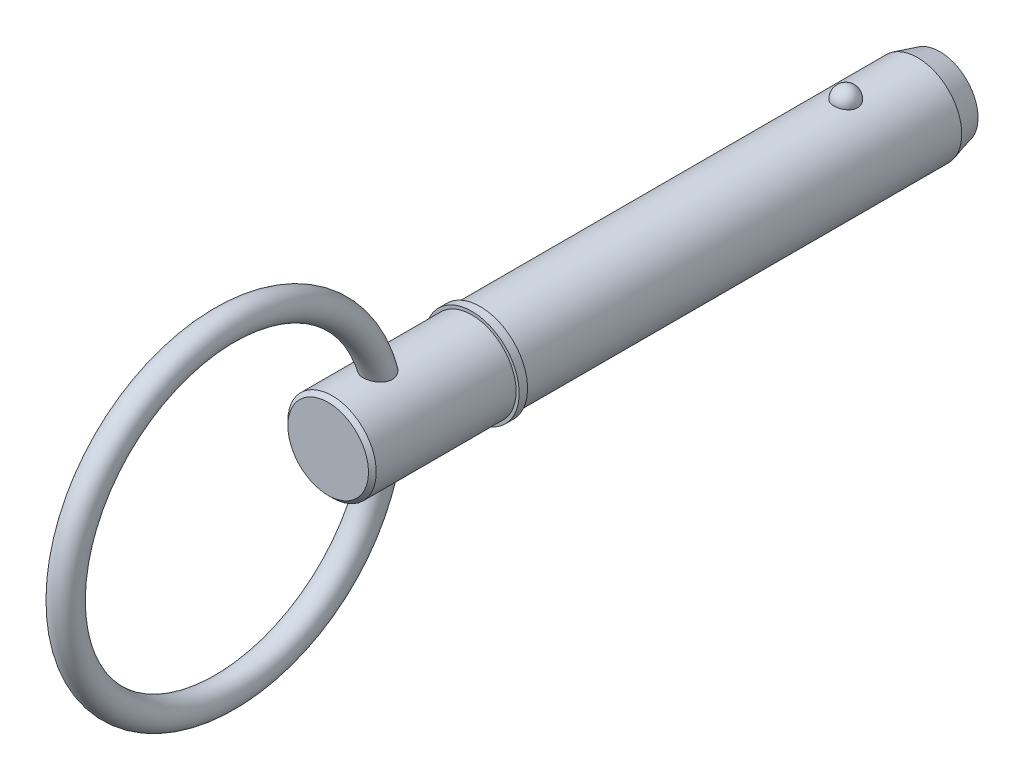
ISO-10303-21;
HEADER;
FILE_DESCRIPTION(('STEP AP214'),'2;1');
FILE_NAME('part.step','',(''),(''),'','','');
FILE_SCHEMA(('AUTOMOTIVE_DESIGN { 1 0 10303 214 1 1 1 1 }'));
ENDSEC;
DATA;
#1=APPLICATION_CONTEXT('core data for automotive mechanical design processes');
#2=APPLICATION_PROTOCOL_DEFINITION('international standard','automotive_design',2000,#1);
#3=PRODUCT_CONTEXT('',#1,'mechanical');
#4=PRODUCT('Part','Part','',(#3));
#5=PRODUCT_RELATED_PRODUCT_CATEGORY('part','',(#4));
#6=PRODUCT_DEFINITION_FORMATION('','',#4);
#7=PRODUCT_DEFINITION_CONTEXT('part definition',#1,'design');
#8=PRODUCT_DEFINITION('design','',#6,#7);
#9=PRODUCT_DEFINITION_SHAPE('','',#8);
#10=(LENGTH_UNIT() NAMED_UNIT(*) SI_UNIT(.MILLI.,.METRE.));
#11=(NAMED_UNIT(*) PLANE_ANGLE_UNIT() SI_UNIT($,.RADIAN.));
#12=(NAMED_UNIT(*) SI_UNIT($,.STERADIAN.) SOLID_ANGLE_UNIT());
#13=UNCERTAINTY_MEASURE_WITH_UNIT(LENGTH_MEASURE(1.E-05),#10,'distance_accuracy_value','');
#14=(GEOMETRIC_REPRESENTATION_CONTEXT(3) GLOBAL_UNCERTAINTY_ASSIGNED_CONTEXT((#13)) GLOBAL_UNIT_ASSIGNED_CONTEXT((#10,
#11,#12)) REPRESENTATION_CONTEXT('',''));
#15=CARTESIAN_POINT('',(0.,0.,0.));
#16=DIRECTION('',(0.,0.,1.));
#17=DIRECTION('',(1.,0.,0.));
#18=AXIS2_PLACEMENT_3D('',#15,#16,#17);
#19=CARTESIAN_POINT('',(0.,0.,63.5));
#20=DIRECTION('',(0.,0.,-1.));
#21=DIRECTION('',(-1.,0.,0.));
#22=AXIS2_PLACEMENT_3D('',#19,#20,#21);
#23=CYLINDRICAL_SURFACE('',#22,7.94);
#24=CARTESIAN_POINT('',(2.13020349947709,7.64891057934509,-2.15));
#25=CARTESIAN_POINT('',(2.1302012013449,7.64891247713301,-2.02978166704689));
#26=CARTESIAN_POINT('',(2.12037546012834,7.65166842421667,-1.90953383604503));
#27=CARTESIAN_POINT('',(2.08130792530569,7.66238579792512,-1.67243962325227));
#28=CARTESIAN_POINT('',(2.05205785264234,7.67034944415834,-1.55559471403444));
#29=CARTESIAN_POINT('',(1.97489181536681,7.69057749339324,-1.32869361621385));
#30=CARTESIAN_POINT('',(1.92698409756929,7.70283999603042,-1.21863445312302));
#31=CARTESIAN_POINT('',(1.81370645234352,7.73029430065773,-1.00831338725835));
#32=CARTESIAN_POINT('',(1.74833715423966,7.7454859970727,-0.908051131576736));
#33=CARTESIAN_POINT('',(1.60144242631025,7.77718699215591,-0.719628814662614));
#34=CARTESIAN_POINT('',(1.51984382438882,7.7937020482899,-0.631526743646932));
#35=CARTESIAN_POINT('',(1.34279837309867,7.82614685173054,-0.470411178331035));
#36=CARTESIAN_POINT('',(1.24735148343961,7.84207659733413,-0.397397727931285));
#37=CARTESIAN_POINT('',(1.04544839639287,7.87153116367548,-0.26868118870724));
#38=CARTESIAN_POINT('',(0.939022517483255,7.88506234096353,-0.212932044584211));
#39=CARTESIAN_POINT('',(0.717931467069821,7.90825597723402,-0.120080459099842));
#40=CARTESIAN_POINT('',(0.603267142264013,7.9179188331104,-0.0829761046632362));
#41=CARTESIAN_POINT('',(0.371015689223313,7.93216561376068,-0.0289596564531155));
#42=CARTESIAN_POINT('',(0.253510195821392,7.93683225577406,-0.0117183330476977));
#43=CARTESIAN_POINT('',(0.0171784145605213,7.94086051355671,0.0031892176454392));
#44=CARTESIAN_POINT('',(-0.101647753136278,7.94022260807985,0.00085721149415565));
#45=CARTESIAN_POINT('',(-0.335567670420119,7.93375751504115,-0.023146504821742));
#46=CARTESIAN_POINT('',(-0.450690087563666,7.92799987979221,-0.0445590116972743));
#47=CARTESIAN_POINT('',(-0.675610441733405,7.91200792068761,-0.105760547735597));
#48=CARTESIAN_POINT('',(-0.785408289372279,7.90177352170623,-0.145549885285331));
#49=CARTESIAN_POINT('',(-0.9972706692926,7.87784802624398,-0.242675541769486));
#50=CARTESIAN_POINT('',(-1.0992893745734,7.86413823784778,-0.300107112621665));
#51=CARTESIAN_POINT('',(-1.29223659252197,7.83474718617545,-0.430887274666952));
#52=CARTESIAN_POINT('',(-1.38316404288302,7.81906573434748,-0.504237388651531));
#53=CARTESIAN_POINT('',(-1.55313516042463,7.78710451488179,-0.666358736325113));
#54=CARTESIAN_POINT('',(-1.63193689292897,7.77081906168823,-0.75538257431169));
#55=CARTESIAN_POINT('',(-1.77366356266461,7.73970270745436,-0.945507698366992));
#56=CARTESIAN_POINT('',(-1.83658745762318,7.72487190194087,-1.04660977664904));
#57=CARTESIAN_POINT('',(-1.94556640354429,7.6981535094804,-1.25927689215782));
#58=CARTESIAN_POINT('',(-1.99143480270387,7.6862989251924,-1.3709418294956));
#59=CARTESIAN_POINT('',(-2.06418311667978,7.66708387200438,-1.60066153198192));
#60=CARTESIAN_POINT('',(-2.0910635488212,7.65972328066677,-1.71871612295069));
#61=CARTESIAN_POINT('',(-2.12508507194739,7.65035479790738,-1.9573607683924));
#62=CARTESIAN_POINT('',(-2.13230490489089,7.64832555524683,-2.0779387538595));
#63=CARTESIAN_POINT('',(-2.12704767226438,7.64978921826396,-2.31862835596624));
#64=CARTESIAN_POINT('',(-2.1145710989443,7.6532819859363,-2.43873998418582));
#65=CARTESIAN_POINT('',(-2.07034166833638,7.66536368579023,-2.67451689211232));
#66=CARTESIAN_POINT('',(-2.03867758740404,7.67392914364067,-2.79020005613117));
#67=CARTESIAN_POINT('',(-1.95694065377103,7.69517736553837,-3.01446692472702));
#68=CARTESIAN_POINT('',(-1.90686710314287,7.70786028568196,-3.12305035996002));
#69=CARTESIAN_POINT('',(-1.78925555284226,7.73600831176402,-3.3306597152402));
#70=CARTESIAN_POINT('',(-1.72162904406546,7.75148739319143,-3.4296336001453));
#71=CARTESIAN_POINT('',(-1.57074739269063,7.78346215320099,-3.61466914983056));
#72=CARTESIAN_POINT('',(-1.48749169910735,7.79995786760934,-3.70073035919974));
#73=CARTESIAN_POINT('',(-1.30720250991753,7.83219119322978,-3.85783594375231));
#74=CARTESIAN_POINT('',(-1.2101234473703,7.84792605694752,-3.92882863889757));
#75=CARTESIAN_POINT('',(-1.00503150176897,7.87681523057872,-4.05342383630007));
#76=CARTESIAN_POINT('',(-0.897019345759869,7.88996971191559,-4.10702749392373));
#77=CARTESIAN_POINT('',(-0.674439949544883,7.91208451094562,-4.19477736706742));
#78=CARTESIAN_POINT('',(-0.55996501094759,7.92109245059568,-4.22914554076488));
#79=CARTESIAN_POINT('',(-0.326625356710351,7.93413878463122,-4.27838865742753));
#80=CARTESIAN_POINT('',(-0.20776113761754,7.93817773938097,-4.29326579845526));
#81=CARTESIAN_POINT('',(0.0287357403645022,7.94081322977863,-4.3030062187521));
#82=CARTESIAN_POINT('',(0.14635312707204,7.93950453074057,-4.29821797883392));
#83=CARTESIAN_POINT('',(0.379062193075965,7.93180098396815,-4.26955229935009));
#84=CARTESIAN_POINT('',(0.494153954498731,7.92540630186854,-4.24567548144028));
#85=CARTESIAN_POINT('',(0.718185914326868,7.90824874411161,-4.17962260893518));
#86=CARTESIAN_POINT('',(0.827145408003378,7.89750055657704,-4.13750805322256));
#87=CARTESIAN_POINT('',(1.03638036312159,7.87277755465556,-4.03615078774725));
#88=CARTESIAN_POINT('',(1.13665531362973,7.85880255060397,-3.97690707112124));
#89=CARTESIAN_POINT('',(1.32729731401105,7.82887859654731,-3.84189297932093));
#90=CARTESIAN_POINT('',(1.41749828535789,7.81290379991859,-3.76589388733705));
#91=CARTESIAN_POINT('',(1.58397257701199,7.78086330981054,-3.59992466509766));
#92=CARTESIAN_POINT('',(1.66024342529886,7.76479760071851,-3.50995206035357));
#93=CARTESIAN_POINT('',(1.79805631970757,7.73405928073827,-3.31688321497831));
#94=CARTESIAN_POINT('',(1.85933944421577,7.719413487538,-3.213597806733));
#95=CARTESIAN_POINT('',(1.96397499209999,7.69345992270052,-2.99796163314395));
#96=CARTESIAN_POINT('',(2.00733488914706,7.68215076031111,-2.88561466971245));
#97=CARTESIAN_POINT('',(2.07068045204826,7.66529896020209,-2.6699413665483));
#98=CARTESIAN_POINT('',(2.09296296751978,7.65919990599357,-2.56732606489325));
#99=CARTESIAN_POINT('',(2.12272535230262,7.65100492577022,-2.35981463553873));
#100=CARTESIAN_POINT('',(2.13020550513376,7.64890892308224,-2.25491855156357));
#101=CARTESIAN_POINT('',(2.13020349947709,7.64891057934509,-2.15));
#102=B_SPLINE_CURVE_WITH_KNOTS('',3,(#24,#25,#26,#27,#28,#29,#30,#31,#32,#33,#34,#35,#36,#37,
#38,#39,#40,#41,#42,#43,#44,#45,#46,#47,#48,#49,#50,#51,#52,#53,#54,#55,#56,#57,#58,#59,#60,#61,
#62,#63,#64,#65,#66,#67,#68,#69,#70,#71,#72,#73,#74,#75,#76,#77,#78,#79,#80,#81,#82,#83,#84,#85,
#86,#87,#88,#89,#90,#91,#92,#93,#94,#95,#96,#97,#98,#99,#100,#101),.UNSPECIFIED.,.T.,.F.,(4,2,2,
2,2,2,2,2,2,2,2,2,2,2,2,2,2,2,2,2,2,2,2,2,2,2,2,2,2,2,2,2,2,2,2,2,2,2,4),(0.,0.360277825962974,
0.720709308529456,1.0809816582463,1.44124102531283,1.80316307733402,2.16508618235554,
2.52603531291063,2.88694740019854,3.24178717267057,3.59659491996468,3.94665496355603,
4.29672088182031,4.64871108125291,5.0007349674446,5.3590619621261,5.71741247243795,
6.079576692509,6.44173104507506,6.80243279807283,7.16312553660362,7.52216203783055,
7.88121215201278,8.24210915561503,8.60301888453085,8.96514709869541,9.32725124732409,
9.68508606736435,10.0428805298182,10.3943622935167,10.7458326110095,11.0961268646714,
11.4464417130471,11.8018724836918,12.1573662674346,12.5186252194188,12.8797333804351,
13.1941658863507,13.5085923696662),.UNSPECIFIED.);
#103=CARTESIAN_POINT('',(2.13020349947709,7.64891057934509,-2.15));
#104=VERTEX_POINT('',#103);
#105=EDGE_CURVE('E102',#104,#104,#102,.T.);
#106=ORIENTED_EDGE('',*,*,#105,.T.);
#107=EDGE_LOOP('',(#106));
#108=FACE_BOUND('',#107,.T.);
#109=CARTESIAN_POINT('',(0.,0.,-15.05));
#110=DIRECTION('',(0.,0.,-1.));
#111=DIRECTION('',(-1.,0.,0.));
#112=AXIS2_PLACEMENT_3D('',#109,#110,#111);
#113=CIRCLE('',#112,7.94);
#114=CARTESIAN_POINT('',(-7.94,0.,-15.05));
#115=VERTEX_POINT('',#114);
#116=EDGE_CURVE('E110',#115,#115,#113,.F.);
#117=ORIENTED_EDGE('',*,*,#116,.T.);
#118=EDGE_LOOP('',(#117));
#119=FACE_BOUND('',#118,.T.);
#120=CARTESIAN_POINT('',(0.,0.,63.5));
#121=DIRECTION('',(0.,0.,1.));
#122=DIRECTION('',(1.,0.,0.));
#123=AXIS2_PLACEMENT_3D('',#120,#121,#122);
#124=CIRCLE('',#123,7.94);
#125=CARTESIAN_POINT('',(7.94,0.,63.5));
#126=VERTEX_POINT('',#125);
#127=EDGE_CURVE('E108',#126,#126,#124,.T.);
#128=ORIENTED_EDGE('',*,*,#127,.F.);
#129=EDGE_LOOP('',(#128));
#130=FACE_BOUND('',#129,.T.);
#131=ADVANCED_FACE('F39',(#108,#119,#130),#23,.T.);
#132=CARTESIAN_POINT('',(0.,0.,-19.05));
#133=DIRECTION('',(0.,0.,-1.));
#134=DIRECTION('',(-1.,0.,0.));
#135=AXIS2_PLACEMENT_3D('',#132,#133,#134);
#136=PLANE('',#135);
#137=CARTESIAN_POINT('',(0.,0.,-19.05));
#138=DIRECTION('',(0.,0.,-1.));
#139=DIRECTION('',(-1.,0.,0.));
#140=AXIS2_PLACEMENT_3D('',#137,#138,#139);
#141=CIRCLE('',#140,6.86820323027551);
#142=CARTESIAN_POINT('',(-6.86820323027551,0.,-19.05));
#143=VERTEX_POINT('',#142);
#144=EDGE_CURVE('E142',#143,#143,#141,.T.);
#145=ORIENTED_EDGE('',*,*,#144,.T.);
#146=EDGE_LOOP('',(#145));
#147=FACE_BOUND('',#146,.T.);
#148=ADVANCED_FACE('F88',(#147),#136,.T.);
#149=CARTESIAN_POINT('',(0.,0.,-19.05));
#150=DIRECTION('',(0.,0.,1.));
#151=DIRECTION('',(1.,0.,0.));
#152=AXIS2_PLACEMENT_3D('',#149,#150,#151);
#153=CONICAL_SURFACE('',#152,6.86820323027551,0.261799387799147);
#154=ORIENTED_EDGE('',*,*,#116,.F.);
#155=EDGE_LOOP('',(#154));
#156=FACE_BOUND('',#155,.T.);
#157=ORIENTED_EDGE('',*,*,#144,.F.);
#158=EDGE_LOOP('',(#157));
#159=FACE_BOUND('',#158,.T.);
#160=ADVANCED_FACE('F94',(#156,#159),#153,.T.);
#161=CARTESIAN_POINT('',(0.,7.94,-2.15));
#162=DIRECTION('',(0.,1.,0.));
#163=DIRECTION('',(0.,0.,1.));
#164=AXIS2_PLACEMENT_3D('',#161,#162,#163);
#165=SPHERICAL_SURFACE('',#164,2.15);
#166=ORIENTED_EDGE('',*,*,#105,.F.);
#167=EDGE_LOOP('',(#166));
#168=FACE_BOUND('',#167,.T.);
#169=ADVANCED_FACE('F113',(#168),#165,.T.);
#170=CARTESIAN_POINT('',(0.,0.,63.5));
#171=DIRECTION('',(0.,0.,-1.));
#172=DIRECTION('',(-1.,0.,0.));
#173=AXIS2_PLACEMENT_3D('',#170,#171,#172);
#174=PLANE('',#173);
#175=ORIENTED_EDGE('',*,*,#127,.T.);
#176=EDGE_LOOP('',(#175));
#177=FACE_BOUND('',#176,.T.);
#178=CARTESIAN_POINT('',(0.,0.,63.5));
#179=DIRECTION('',(0.,0.,-1.));
#180=DIRECTION('',(-1.,0.,0.));
#181=AXIS2_PLACEMENT_3D('',#178,#179,#180);
#182=CIRCLE('',#181,8.5);
#183=CARTESIAN_POINT('',(-8.5,0.,63.5));
#184=VERTEX_POINT('',#183);
#185=EDGE_CURVE('E109',#184,#184,#182,.T.);
#186=ORIENTED_EDGE('',*,*,#185,.T.);
#187=EDGE_LOOP('',(#186));
#188=FACE_BOUND('',#187,.T.);
#189=ADVANCED_FACE('F117',(#177,#188),#174,.T.);
#190=CARTESIAN_POINT('',(0.,0.,33.7287874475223));
#191=DIRECTION('',(0.,0.,-1.));
#192=DIRECTION('',(-1.,0.,0.));
#193=AXIS2_PLACEMENT_3D('',#190,#191,#192);
#194=CYLINDRICAL_SURFACE('',#193,8.5);
#195=CARTESIAN_POINT('',(0.,0.,65.));
#196=DIRECTION('',(0.,0.,-1.));
#197=DIRECTION('',(-1.,0.,0.));
#198=AXIS2_PLACEMENT_3D('',#195,#196,#197);
#199=CIRCLE('',#198,8.5);
#200=CARTESIAN_POINT('',(-8.5,0.,65.));
#201=VERTEX_POINT('',#200);
#202=EDGE_CURVE('E134',#201,#201,#199,.T.);
#203=ORIENTED_EDGE('',*,*,#202,.T.);
#204=EDGE_LOOP('',(#203));
#205=FACE_BOUND('',#204,.T.);
#206=ORIENTED_EDGE('',*,*,#185,.F.);
#207=EDGE_LOOP('',(#206));
#208=FACE_BOUND('',#207,.T.);
#209=ADVANCED_FACE('F121',(#205,#208),#194,.T.);
#210=CARTESIAN_POINT('',(0.,8.5,65.));
#211=DIRECTION('',(0.,0.,1.));
#212=DIRECTION('',(1.,0.,0.));
#213=AXIS2_PLACEMENT_3D('',#210,#211,#212);
#214=PLANE('',#213);
#215=CARTESIAN_POINT('',(0.,0.,65.));
#216=DIRECTION('',(0.,0.,1.));
#217=DIRECTION('',(1.,0.,0.));
#218=AXIS2_PLACEMENT_3D('',#215,#216,#217);
#219=CIRCLE('',#218,7.94);
#220=CARTESIAN_POINT('',(7.94,0.,65.));
#221=VERTEX_POINT('',#220);
#222=EDGE_CURVE('E112',#221,#221,#219,.T.);
#223=ORIENTED_EDGE('',*,*,#222,.F.);
#224=EDGE_LOOP('',(#223));
#225=FACE_BOUND('',#224,.T.);
#226=ORIENTED_EDGE('',*,*,#202,.F.);
#227=EDGE_LOOP('',(#226));
#228=FACE_BOUND('',#227,.T.);
#229=ADVANCED_FACE('F85',(#225,#228),#214,.T.);
#230=CARTESIAN_POINT('',(0.,0.,90.81));
#231=DIRECTION('',(0.,0.,-1.));
#232=DIRECTION('',(-1.,0.,0.));
#233=AXIS2_PLACEMENT_3D('',#230,#231,#232);
#234=CYLINDRICAL_SURFACE('',#233,7.94);
#235=CARTESIAN_POINT('',(-1.15544091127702,-7.85547938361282,79.611910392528));
#236=CARTESIAN_POINT('',(-1.03089695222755,-7.87379554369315,79.5496153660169));
#237=CARTESIAN_POINT('',(-0.900845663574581,-7.8898743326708,79.4975936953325));
#238=CARTESIAN_POINT('',(-0.633417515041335,-7.91583465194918,79.415265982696));
#239=CARTESIAN_POINT('',(-0.496037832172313,-7.92571377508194,79.3849683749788));
#240=CARTESIAN_POINT('',(-0.217881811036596,-7.93823020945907,79.3467734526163));
#241=CARTESIAN_POINT('',(-0.0771057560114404,-7.94086812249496,79.3388742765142));
#242=CARTESIAN_POINT('',(0.20382834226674,-7.93862624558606,79.3456489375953));
#243=CARTESIAN_POINT('',(0.343986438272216,-7.93374711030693,79.3603208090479));
#244=CARTESIAN_POINT('',(0.61954486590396,-7.9169944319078,79.4118776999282));
#245=CARTESIAN_POINT('',(0.754950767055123,-7.9051293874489,79.448735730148));
#246=CARTESIAN_POINT('',(1.01737529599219,-7.8756583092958,79.5438425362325));
#247=CARTESIAN_POINT('',(1.14439334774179,-7.85805188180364,79.6020927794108));
#248=CARTESIAN_POINT('',(1.38668443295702,-7.81893907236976,79.7388428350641));
#249=CARTESIAN_POINT('',(1.50193494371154,-7.79742542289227,79.8173804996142));
#250=CARTESIAN_POINT('',(1.71711272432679,-7.75288428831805,79.9928724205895));
#251=CARTESIAN_POINT('',(1.81704089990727,-7.72985689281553,80.0898255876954));
#252=CARTESIAN_POINT('',(1.99787261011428,-7.68509802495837,80.2988714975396));
#253=CARTESIAN_POINT('',(2.07893183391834,-7.66335713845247,80.4108273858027));
#254=CARTESIAN_POINT('',(2.2207658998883,-7.6234672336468,80.6474809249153));
#255=CARTESIAN_POINT('',(2.28154607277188,-7.6053172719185,80.7721752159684));
#256=CARTESIAN_POINT('',(2.38011540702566,-7.57504217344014,81.0276189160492));
#257=CARTESIAN_POINT('',(2.41840843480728,-7.56278621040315,81.1581588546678));
#258=CARTESIAN_POINT('',(2.47363993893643,-7.54490265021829,81.424095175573));
#259=CARTESIAN_POINT('',(2.49057788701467,-7.53927521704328,81.5594916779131));
#260=CARTESIAN_POINT('',(2.50351014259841,-7.53499042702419,81.8324287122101));
#261=CARTESIAN_POINT('',(2.49933630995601,-7.53638902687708,81.9699777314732));
#262=CARTESIAN_POINT('',(2.47072547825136,-7.54581524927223,82.2426982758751));
#263=CARTESIAN_POINT('',(2.44628184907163,-7.55384504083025,82.3778690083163));
#264=CARTESIAN_POINT('',(2.3758931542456,-7.57629160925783,82.6530857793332));
#265=CARTESIAN_POINT('',(2.32844094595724,-7.5911515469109,82.7927089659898));
#266=CARTESIAN_POINT('',(2.21332780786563,-7.62550828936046,83.0627818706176));
#267=CARTESIAN_POINT('',(2.14565489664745,-7.64500784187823,83.1932260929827));
#268=CARTESIAN_POINT('',(1.98438755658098,-7.68852412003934,83.4537020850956));
#269=CARTESIAN_POINT('',(1.88896913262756,-7.71279219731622,83.5825698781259));
#270=CARTESIAN_POINT('',(1.67743245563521,-7.76154719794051,83.822112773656));
#271=CARTESIAN_POINT('',(1.56130644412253,-7.78603420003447,83.9327810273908));
#272=CARTESIAN_POINT('',(1.31168281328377,-7.83191501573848,84.1301000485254));
#273=CARTESIAN_POINT('',(1.17841631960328,-7.85334315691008,84.2170293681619));
#274=CARTESIAN_POINT('',(0.967442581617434,-7.88116219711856,84.3266577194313));
#275=CARTESIAN_POINT('',(0.895283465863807,-7.88971376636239,84.3597363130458));
#276=CARTESIAN_POINT('',(0.747777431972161,-7.90505596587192,84.4184005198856));
#277=CARTESIAN_POINT('',(0.672431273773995,-7.91184701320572,84.4439879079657));
#278=CARTESIAN_POINT('',(0.53057561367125,-7.92252382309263,84.4839121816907));
#279=CARTESIAN_POINT('',(0.464394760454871,-7.92668987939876,84.499349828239));
#280=CARTESIAN_POINT('',(0.330815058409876,-7.9333870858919,84.5240698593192));
#281=CARTESIAN_POINT('',(0.263416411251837,-7.93591850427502,84.5333532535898));
#282=CARTESIAN_POINT('',(0.128041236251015,-7.93925585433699,84.5455779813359));
#283=CARTESIAN_POINT('',(0.0600650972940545,-7.94006286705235,84.5485232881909));
#284=CARTESIAN_POINT('',(-0.0758408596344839,-7.93992929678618,84.5480336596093));
#285=CARTESIAN_POINT('',(-0.143770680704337,-7.93898884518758,84.5445992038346));
#286=CARTESIAN_POINT('',(-0.330023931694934,-7.93402174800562,84.5264060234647));
#287=CARTESIAN_POINT('',(-0.447720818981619,-7.92820264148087,84.5050608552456));
#288=CARTESIAN_POINT('',(-0.677833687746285,-7.91185818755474,84.4440930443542));
#289=CARTESIAN_POINT('',(-0.790248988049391,-7.90133223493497,84.4044680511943));
#290=CARTESIAN_POINT('',(-1.01082100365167,-7.8762011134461,84.3074365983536));
#291=CARTESIAN_POINT('',(-1.11873674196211,-7.86147932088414,84.249515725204));
#292=CARTESIAN_POINT('',(-1.32464461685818,-7.8294189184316,84.1187556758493));
#293=CARTESIAN_POINT('',(-1.42263264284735,-7.81207923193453,84.0459103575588));
#294=CARTESIAN_POINT('',(-1.62038324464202,-7.77363945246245,83.8765366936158));
#295=CARTESIAN_POINT('',(-1.7184938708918,-7.75235190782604,83.7781231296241));
#296=CARTESIAN_POINT('',(-1.89908721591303,-7.71010284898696,83.5677830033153));
#297=CARTESIAN_POINT('',(-1.9815587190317,-7.68914157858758,83.4558468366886));
#298=CARTESIAN_POINT('',(-2.13974270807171,-7.64674394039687,83.2051085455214));
#299=CARTESIAN_POINT('',(-2.21304020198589,-7.62562536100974,83.0647194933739));
#300=CARTESIAN_POINT('',(-2.33615659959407,-7.58881542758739,82.7732666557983));
#301=CARTESIAN_POINT('',(-2.38596943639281,-7.57312547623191,82.6222001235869));
#302=CARTESIAN_POINT('',(-2.46059473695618,-7.54921618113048,82.3104922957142));
#303=CARTESIAN_POINT('',(-2.48494918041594,-7.54113395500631,82.1497288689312));
#304=CARTESIAN_POINT('',(-2.50480773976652,-7.53456588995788,81.8262447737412));
#305=CARTESIAN_POINT('',(-2.50033692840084,-7.53607171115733,81.6635259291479));
#306=CARTESIAN_POINT('',(-2.46306926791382,-7.54832452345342,81.3571659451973));
#307=CARTESIAN_POINT('',(-2.4329569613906,-7.55819528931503,81.2131623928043));
#308=CARTESIAN_POINT('',(-2.34806892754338,-7.58499431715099,80.9333040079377));
#309=CARTESIAN_POINT('',(-2.29330013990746,-7.60192059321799,80.7974468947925));
#310=CARTESIAN_POINT('',(-2.16523724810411,-7.63933506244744,80.5476573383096));
#311=CARTESIAN_POINT('',(-2.09353456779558,-7.65948502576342,80.4328530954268));
#312=CARTESIAN_POINT('',(-1.93200913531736,-7.7018104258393,80.2172680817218));
#313=CARTESIAN_POINT('',(-1.84219262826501,-7.72398516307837,80.1164824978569));
#314=CARTESIAN_POINT('',(-1.65746337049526,-7.76558957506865,79.9413148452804));
#315=CARTESIAN_POINT('',(-1.56413624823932,-7.78505810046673,79.8652591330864));
#316=CARTESIAN_POINT('',(-1.36706423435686,-7.82207051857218,79.7275357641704));
#317=CARTESIAN_POINT('',(-1.26331856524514,-7.83961426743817,79.6658691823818));
#318=CARTESIAN_POINT('',(-1.15544091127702,-7.85547938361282,79.611910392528));
#319=B_SPLINE_CURVE_WITH_KNOTS('',3,(#235,#236,#237,#238,#239,#240,#241,#242,#243,#244,#245,
#246,#247,#248,#249,#250,#251,#252,#253,#254,#255,#256,#257,#258,#259,#260,#261,#262,#263,#264,
#265,#266,#267,#268,#269,#270,#271,#272,#273,#274,#275,#276,#277,#278,#279,#280,#281,#282,#283,
#284,#285,#286,#287,#288,#289,#290,#291,#292,#293,#294,#295,#296,#297,#298,#299,#300,#301,#302,
#303,#304,#305,#306,#307,#308,#309,#310,#311,#312,#313,#314,#315,#316,#317,#318),.UNSPECIFIED.,
.T.,.F.,(4,2,2,2,2,2,2,2,2,2,2,2,2,2,2,2,2,2,2,2,2,2,2,2,2,2,2,2,2,2,2,2,2,2,2,2,2,2,2,2,2,4),
(0.,0.420927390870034,0.842018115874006,1.26307384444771,1.68409290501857,2.10460083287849,
2.52513760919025,2.94646475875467,3.36776699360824,3.7854589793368,4.20304108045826,
4.61086922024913,5.01870744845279,5.42979890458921,5.84102487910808,6.2838331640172,
6.72690434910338,7.21113455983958,7.69554657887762,8.17400305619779,8.41316278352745,
8.65226580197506,8.85622998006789,9.0601606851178,9.26396350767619,9.46775100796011,
9.82521046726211,10.1827159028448,10.5513335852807,10.9201032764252,11.3402098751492,
11.7606166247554,12.2377707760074,12.715048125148,13.2007716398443,13.6860727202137,
14.1260485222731,14.5659005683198,14.9745225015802,15.3830037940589,15.7475760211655,
16.1121754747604),.UNSPECIFIED.);
#320=CARTESIAN_POINT('',(-1.15544091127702,-7.85547938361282,79.611910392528));
#321=VERTEX_POINT('',#320);
#322=EDGE_CURVE('E10',#321,#321,#319,.T.);
#323=ORIENTED_EDGE('',*,*,#322,.F.);
#324=EDGE_LOOP('',(#323));
#325=FACE_BOUND('',#324,.T.);
#326=CARTESIAN_POINT('',(-1.15544091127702,7.85547938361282,79.611910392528));
#327=CARTESIAN_POINT('',(-1.278579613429,7.83736699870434,79.6735072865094));
#328=CARTESIAN_POINT('',(-1.39638360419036,7.8170599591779,79.7451720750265));
#329=CARTESIAN_POINT('',(-1.61803025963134,7.77421032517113,79.9070825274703));
#330=CARTESIAN_POINT('',(-1.72186951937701,7.7516671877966,79.9973327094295));
#331=CARTESIAN_POINT('',(-1.9126968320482,7.70680387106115,80.1943958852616));
#332=CARTESIAN_POINT('',(-1.99967065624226,7.68448389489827,80.3012227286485));
#333=CARTESIAN_POINT('',(-2.15412555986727,7.64262858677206,80.5286078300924));
#334=CARTESIAN_POINT('',(-2.2216118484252,7.62309251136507,80.6491624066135));
#335=CARTESIAN_POINT('',(-2.3342927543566,7.5893410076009,80.898377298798));
#336=CARTESIAN_POINT('',(-2.3798562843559,7.57503857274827,81.0268591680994));
#337=CARTESIAN_POINT('',(-2.44955571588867,7.55278941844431,81.290011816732));
#338=CARTESIAN_POINT('',(-2.47369226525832,7.544842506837,81.4246824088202));
#339=CARTESIAN_POINT('',(-2.50059611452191,7.53596831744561,81.6961377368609));
#340=CARTESIAN_POINT('',(-2.50339277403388,7.53503139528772,81.8329193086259));
#341=CARTESIAN_POINT('',(-2.48855779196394,7.53994222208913,82.1052240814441));
#342=CARTESIAN_POINT('',(-2.47092012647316,7.54579197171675,82.2407468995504));
#343=CARTESIAN_POINT('',(-2.41469361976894,7.56397908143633,82.5162931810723));
#344=CARTESIAN_POINT('',(-2.37479606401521,7.57671999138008,82.6560213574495));
#345=CARTESIAN_POINT('',(-2.27489955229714,7.60730881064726,82.9275158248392));
#346=CARTESIAN_POINT('',(-2.2148900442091,7.6251594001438,83.0592778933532));
#347=CARTESIAN_POINT('',(-2.06943931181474,7.66598084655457,83.3245250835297));
#348=CARTESIAN_POINT('',(-1.98208275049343,7.68928197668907,83.4569147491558));
#349=CARTESIAN_POINT('',(-1.78658869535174,7.73704343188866,83.7052357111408));
#350=CARTESIAN_POINT('',(-1.67843905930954,7.76150442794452,83.821157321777));
#351=CARTESIAN_POINT('',(-1.44142605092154,7.80900750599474,84.0336999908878));
#352=CARTESIAN_POINT('',(-1.31231821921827,7.83202775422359,84.1300586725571));
#353=CARTESIAN_POINT('',(-1.10627655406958,7.86286215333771,84.2546145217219));
#354=CARTESIAN_POINT('',(-1.035525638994,7.87252500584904,84.2928053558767));
#355=CARTESIAN_POINT('',(-0.890375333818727,7.89025728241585,84.3618851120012));
#356=CARTESIAN_POINT('',(-0.815978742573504,7.89832790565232,84.3927795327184));
#357=CARTESIAN_POINT('',(-0.674180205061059,7.91160332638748,84.4430828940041));
#358=CARTESIAN_POINT('',(-0.607145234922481,7.91704543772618,84.463468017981));
#359=CARTESIAN_POINT('',(-0.471385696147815,7.92628663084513,84.4978763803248));
#360=CARTESIAN_POINT('',(-0.402662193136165,7.93008672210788,84.5119035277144));
#361=CARTESIAN_POINT('',(-0.264153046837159,7.9359070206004,84.533322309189));
#362=CARTESIAN_POINT('',(-0.194368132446,7.9379283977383,84.5407183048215));
#363=CARTESIAN_POINT('',(-0.0544054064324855,7.940122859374,84.5487430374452));
#364=CARTESIAN_POINT('',(0.0157723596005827,7.94029615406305,84.5493725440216));
#365=CARTESIAN_POINT('',(0.206295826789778,7.93822912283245,84.5418250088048));
#366=CARTESIAN_POINT('',(0.326425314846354,7.93416340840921,84.5269891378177));
#367=CARTESIAN_POINT('',(0.562310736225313,7.92094769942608,84.4780777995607));
#368=CARTESIAN_POINT('',(0.678066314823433,7.91179729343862,84.44400077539));
#369=CARTESIAN_POINT('',(0.903029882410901,7.88929555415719,84.3582699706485));
#370=CARTESIAN_POINT('',(1.01220356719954,7.87592415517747,84.3065321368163));
#371=CARTESIAN_POINT('',(1.22142047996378,7.84620431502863,84.1877939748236));
#372=CARTESIAN_POINT('',(1.32146048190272,7.82985482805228,84.1207882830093));
#373=CARTESIAN_POINT('',(1.52328754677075,7.7932678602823,83.9643092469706));
#374=CARTESIAN_POINT('',(1.6236508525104,7.77280069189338,83.8730560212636));
#375=CARTESIAN_POINT('',(1.80985117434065,7.73156849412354,83.6768153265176));
#376=CARTESIAN_POINT('',(1.895678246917,7.71080327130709,83.5718185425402));
#377=CARTESIAN_POINT('',(2.06302404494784,7.66785771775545,83.3345434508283));
#378=CARTESIAN_POINT('',(2.14213178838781,7.64590590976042,83.2005149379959));
#379=CARTESIAN_POINT('',(2.27825755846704,7.60645646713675,82.9209949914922));
#380=CARTESIAN_POINT('',(2.33526577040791,7.58896081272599,82.7754984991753));
#381=CARTESIAN_POINT('',(2.42707573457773,7.56011538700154,82.4702423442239));
#382=CARTESIAN_POINT('',(2.4608459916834,7.54905411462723,82.3101404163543));
#383=CARTESIAN_POINT('',(2.49980168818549,7.53624914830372,81.9861292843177));
#384=CARTESIAN_POINT('',(2.50500938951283,7.5344981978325,81.8222231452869));
#385=CARTESIAN_POINT('',(2.48594104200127,7.54080673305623,81.5099762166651));
#386=CARTESIAN_POINT('',(2.46407777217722,7.54806351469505,81.3614732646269));
#387=CARTESIAN_POINT('',(2.3945479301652,7.57040718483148,81.071258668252));
#388=CARTESIAN_POINT('',(2.34689355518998,7.58549037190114,80.9295438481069));
#389=CARTESIAN_POINT('',(2.2318274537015,7.62009243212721,80.6691410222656));
#390=CARTESIAN_POINT('',(2.16637710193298,7.63914093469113,80.5495179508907));
#391=CARTESIAN_POINT('',(2.01638736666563,7.68009146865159,80.3234609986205));
#392=CARTESIAN_POINT('',(1.93184850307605,7.7019934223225,80.2170267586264));
#393=CARTESIAN_POINT('',(1.74664202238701,7.74608439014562,80.0206697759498));
#394=CARTESIAN_POINT('',(1.64607913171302,7.76827073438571,79.9306474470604));
#395=CARTESIAN_POINT('',(1.43119791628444,7.81071401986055,79.7683086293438));
#396=CARTESIAN_POINT('',(1.31687846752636,7.83097080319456,79.6959935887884));
#397=CARTESIAN_POINT('',(1.07477437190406,7.86789551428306,79.5691492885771));
#398=CARTESIAN_POINT('',(0.946739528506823,7.88446964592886,79.5150698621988));
#399=CARTESIAN_POINT('',(0.683029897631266,7.91167708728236,79.4282136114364));
#400=CARTESIAN_POINT('',(0.547354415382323,7.92230985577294,79.3954387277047));
#401=CARTESIAN_POINT('',(0.271066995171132,7.93658630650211,79.351730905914));
#402=CARTESIAN_POINT('',(0.130424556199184,7.94017418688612,79.3409723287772));
#403=CARTESIAN_POINT('',(-0.150736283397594,7.93981282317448,79.3420624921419));
#404=CARTESIAN_POINT('',(-0.291254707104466,7.93586558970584,79.353905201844));
#405=CARTESIAN_POINT('',(-0.556023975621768,7.92151946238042,79.3978917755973));
#406=CARTESIAN_POINT('',(-0.68062174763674,7.91171585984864,79.4281668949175));
#407=CARTESIAN_POINT('',(-0.923476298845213,7.88705844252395,79.5067364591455));
#408=CARTESIAN_POINT('',(-1.04173303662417,7.87220459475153,79.5550310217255));
#409=CARTESIAN_POINT('',(-1.15544091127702,7.85547938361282,79.611910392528));
#410=B_SPLINE_CURVE_WITH_KNOTS('',3,(#326,#327,#328,#329,#330,#331,#332,#333,#334,#335,#336,
#337,#338,#339,#340,#341,#342,#343,#344,#345,#346,#347,#348,#349,#350,#351,#352,#353,#354,#355,
#356,#357,#358,#359,#360,#361,#362,#363,#364,#365,#366,#367,#368,#369,#370,#371,#372,#373,#374,
#375,#376,#377,#378,#379,#380,#381,#382,#383,#384,#385,#386,#387,#388,#389,#390,#391,#392,#393,
#394,#395,#396,#397,#398,#399,#400,#401,#402,#403,#404,#405,#406,#407,#408,#409),.UNSPECIFIED.,
.T.,.F.,(4,2,2,2,2,2,2,2,2,2,2,2,2,2,2,2,2,2,2,2,2,2,2,2,2,2,2,2,2,2,2,2,2,2,2,2,2,2,2,2,2,4),
(0.,0.416167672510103,0.832436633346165,1.24905527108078,1.66556244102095,2.07479168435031,
2.48400855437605,2.89266231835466,3.30143658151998,3.73725068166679,4.17329379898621,
4.65204873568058,5.13108409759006,5.61617224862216,5.85876072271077,6.10116578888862,
6.31168904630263,6.52208269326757,6.73233785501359,6.94256910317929,7.30398888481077,
7.66543791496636,8.02863174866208,8.39195337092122,8.80190673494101,9.21213940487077,
9.68159903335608,10.1512669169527,10.6406305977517,11.1296128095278,11.5779838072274,
12.0261429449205,12.4372146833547,12.8482752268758,13.256751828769,13.6652618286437,
14.0832160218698,14.5012082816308,14.9224982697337,15.3436758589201,15.72796797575,
16.1122626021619),.UNSPECIFIED.);
#411=CARTESIAN_POINT('',(-1.15544091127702,7.85547938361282,79.611910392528));
#412=VERTEX_POINT('',#411);
#413=EDGE_CURVE('E51',#412,#412,#410,.T.);
#414=ORIENTED_EDGE('',*,*,#413,.F.);
#415=EDGE_LOOP('',(#414));
#416=FACE_BOUND('',#415,.T.);
#417=CARTESIAN_POINT('',(0.,0.,90.11));
#418=DIRECTION('',(0.,0.,-1.));
#419=DIRECTION('',(-1.,0.,0.));
#420=AXIS2_PLACEMENT_3D('',#417,#418,#419);
#421=CIRCLE('',#420,7.94);
#422=CARTESIAN_POINT('',(-7.94,0.,90.11));
#423=VERTEX_POINT('',#422);
#424=EDGE_CURVE('E64',#423,#423,#421,.T.);
#425=ORIENTED_EDGE('',*,*,#424,.T.);
#426=EDGE_LOOP('',(#425));
#427=FACE_BOUND('',#426,.T.);
#428=ORIENTED_EDGE('',*,*,#222,.T.);
#429=EDGE_LOOP('',(#428));
#430=FACE_BOUND('',#429,.T.);
#431=ADVANCED_FACE('F69',(#325,#416,#427,#430),#234,.T.);
#432=CARTESIAN_POINT('',(0.,0.,90.81));
#433=DIRECTION('',(0.,0.,-1.));
#434=DIRECTION('',(-1.,0.,0.));
#435=AXIS2_PLACEMENT_3D('',#432,#433,#434);
#436=PLANE('',#435);
#437=CARTESIAN_POINT('',(0.,0.,90.81));
#438=DIRECTION('',(0.,0.,-1.));
#439=DIRECTION('',(-1.,0.,0.));
#440=AXIS2_PLACEMENT_3D('',#437,#438,#439);
#441=CIRCLE('',#440,7.24);
#442=CARTESIAN_POINT('',(-7.24,0.,90.81));
#443=VERTEX_POINT('',#442);
#444=EDGE_CURVE('E57',#443,#443,#441,.F.);
#445=ORIENTED_EDGE('',*,*,#444,.T.);
#446=EDGE_LOOP('',(#445));
#447=FACE_BOUND('',#446,.T.);
#448=ADVANCED_FACE('F76',(#447),#436,.F.);
#449=CARTESIAN_POINT('',(0.,0.,90.11));
#450=DIRECTION('',(0.,0.,-1.));
#451=DIRECTION('',(-1.,0.,0.));
#452=AXIS2_PLACEMENT_3D('',#449,#450,#451);
#453=CONICAL_SURFACE('',#452,7.94,0.785398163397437);
#454=ORIENTED_EDGE('',*,*,#444,.F.);
#455=EDGE_LOOP('',(#454));
#456=FACE_BOUND('',#455,.T.);
#457=ORIENTED_EDGE('',*,*,#424,.F.);
#458=EDGE_LOOP('',(#457));
#459=FACE_BOUND('',#458,.T.);
#460=ADVANCED_FACE('F41',(#456,#459),#453,.T.);
#461=CARTESIAN_POINT('',(0.,0.,109.385));
#462=DIRECTION('',(1.,0.,0.));
#463=DIRECTION('',(0.,0.,-1.));
#464=AXIS2_PLACEMENT_3D('',#461,#462,#463);
#465=TOROIDAL_SURFACE('',#464,28.575,2.5);
#466=ORIENTED_EDGE('',*,*,#322,.T.);
#467=EDGE_LOOP('',(#466));
#468=FACE_BOUND('',#467,.T.);
#469=ORIENTED_EDGE('',*,*,#413,.T.);
#470=EDGE_LOOP('',(#469));
#471=FACE_BOUND('',#470,.T.);
#472=ADVANCED_FACE('F73',(#468,#471),#465,.T.);
#473=CLOSED_SHELL('',(#131,#148,#160,#169,#189,#209,#229,#431,#448,#460,#472));
#474=MANIFOLD_SOLID_BREP('B2',#473);
#475=ADVANCED_BREP_SHAPE_REPRESENTATION('',(#18,#474),#14);
#476=SHAPE_DEFINITION_REPRESENTATION(#9,#475);
ENDSEC;
END-ISO-10303-21;
